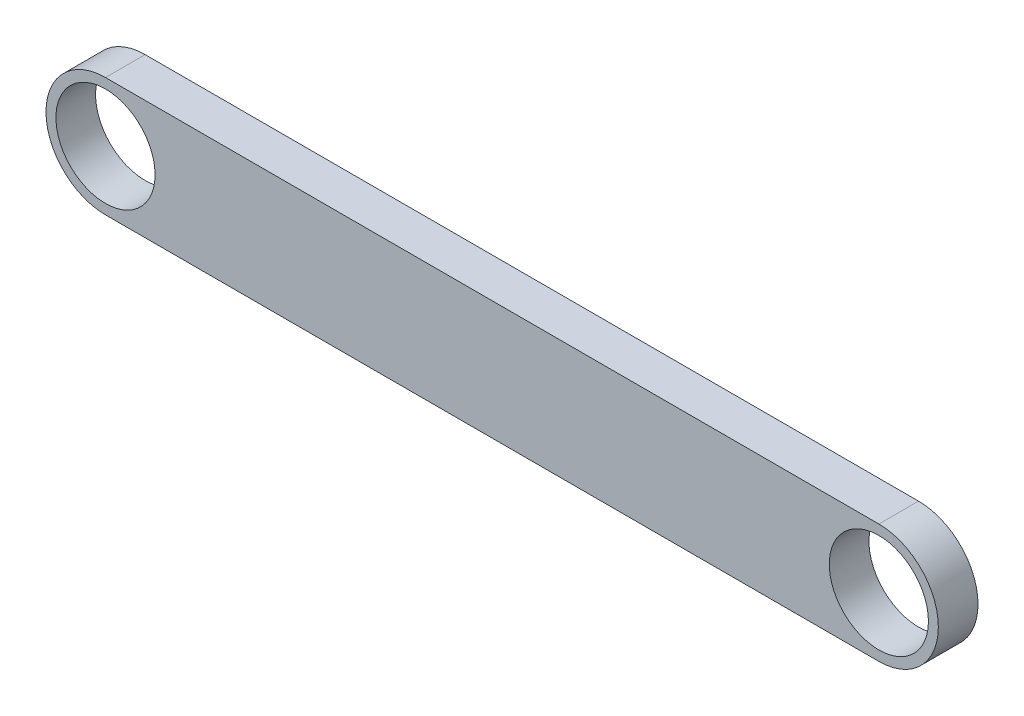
ISO-10303-21;
HEADER;
FILE_DESCRIPTION(('STEP AP214'),'2;1');
FILE_NAME('part.step','',(''),(''),'','','');
FILE_SCHEMA(('AUTOMOTIVE_DESIGN { 1 0 10303 214 1 1 1 1 }'));
ENDSEC;
DATA;
#1=APPLICATION_CONTEXT('core data for automotive mechanical design processes');
#2=APPLICATION_PROTOCOL_DEFINITION('international standard','automotive_design',2000,#1);
#3=PRODUCT_CONTEXT('',#1,'mechanical');
#4=PRODUCT('Part','Part','',(#3));
#5=PRODUCT_RELATED_PRODUCT_CATEGORY('part','',(#4));
#6=PRODUCT_DEFINITION_FORMATION('','',#4);
#7=PRODUCT_DEFINITION_CONTEXT('part definition',#1,'design');
#8=PRODUCT_DEFINITION('design','',#6,#7);
#9=PRODUCT_DEFINITION_SHAPE('','',#8);
#10=(LENGTH_UNIT() NAMED_UNIT(*) SI_UNIT(.MILLI.,.METRE.));
#11=(NAMED_UNIT(*) PLANE_ANGLE_UNIT() SI_UNIT($,.RADIAN.));
#12=(NAMED_UNIT(*) SI_UNIT($,.STERADIAN.) SOLID_ANGLE_UNIT());
#13=UNCERTAINTY_MEASURE_WITH_UNIT(LENGTH_MEASURE(1.E-05),#10,'distance_accuracy_value','');
#14=(GEOMETRIC_REPRESENTATION_CONTEXT(3) GLOBAL_UNCERTAINTY_ASSIGNED_CONTEXT((#13)) GLOBAL_UNIT_ASSIGNED_CONTEXT((#10,
#11,#12)) REPRESENTATION_CONTEXT('',''));
#15=CARTESIAN_POINT('',(0.,0.,0.));
#16=DIRECTION('',(0.,0.,1.));
#17=DIRECTION('',(1.,0.,0.));
#18=AXIS2_PLACEMENT_3D('',#15,#16,#17);
#19=CARTESIAN_POINT('',(0.,0.,10.));
#20=DIRECTION('',(0.,0.,1.));
#21=DIRECTION('',(1.,0.,0.));
#22=AXIS2_PLACEMENT_3D('',#19,#20,#21);
#23=PLANE('',#22);
#24=CARTESIAN_POINT('',(0.,0.,10.));
#25=DIRECTION('',(0.,0.,1.));
#26=DIRECTION('',(1.,0.,0.));
#27=AXIS2_PLACEMENT_3D('',#24,#25,#26);
#28=CIRCLE('',#27,12.5);
#29=CARTESIAN_POINT('',(12.5,0.,10.));
#30=VERTEX_POINT('',#29);
#31=EDGE_CURVE('E100',#30,#30,#28,.T.);
#32=ORIENTED_EDGE('',*,*,#31,.F.);
#33=EDGE_LOOP('',(#32));
#34=FACE_BOUND('',#33,.T.);
#35=CARTESIAN_POINT('',(0.,0.,10.));
#36=DIRECTION('',(0.,0.,1.));
#37=DIRECTION('',(1.,0.,0.));
#38=AXIS2_PLACEMENT_3D('',#35,#36,#37);
#39=CIRCLE('',#38,15.);
#40=CARTESIAN_POINT('',(0.,15.,10.));
#41=VERTEX_POINT('',#40);
#42=CARTESIAN_POINT('',(0.,-15.,10.));
#43=VERTEX_POINT('',#42);
#44=EDGE_CURVE('E85',#41,#43,#39,.T.);
#45=ORIENTED_EDGE('',*,*,#44,.T.);
#46=DIRECTION('',(1.,0.,0.));
#47=VECTOR('',#46,1.);
#48=CARTESIAN_POINT('',(0.,-15.,10.));
#49=LINE('',#48,#47);
#50=CARTESIAN_POINT('',(195.,-15.,10.));
#51=VERTEX_POINT('',#50);
#52=EDGE_CURVE('E80',#43,#51,#49,.T.);
#53=ORIENTED_EDGE('',*,*,#52,.T.);
#54=CARTESIAN_POINT('',(195.,0.,10.));
#55=DIRECTION('',(0.,0.,1.));
#56=DIRECTION('',(1.,0.,0.));
#57=AXIS2_PLACEMENT_3D('',#54,#55,#56);
#58=CIRCLE('',#57,15.);
#59=CARTESIAN_POINT('',(195.,15.,10.));
#60=VERTEX_POINT('',#59);
#61=EDGE_CURVE('E83',#51,#60,#58,.T.);
#62=ORIENTED_EDGE('',*,*,#61,.T.);
#63=DIRECTION('',(-1.,0.,0.));
#64=VECTOR('',#63,1.);
#65=CARTESIAN_POINT('',(0.,15.,10.));
#66=LINE('',#65,#64);
#67=EDGE_CURVE('E50',#60,#41,#66,.T.);
#68=ORIENTED_EDGE('',*,*,#67,.T.);
#69=EDGE_LOOP('',(#45,#53,#62,#68));
#70=FACE_BOUND('',#69,.T.);
#71=CARTESIAN_POINT('',(195.,0.,10.));
#72=DIRECTION('',(0.,0.,1.));
#73=DIRECTION('',(1.,0.,0.));
#74=AXIS2_PLACEMENT_3D('',#71,#72,#73);
#75=CIRCLE('',#74,12.5);
#76=CARTESIAN_POINT('',(207.5,0.,10.));
#77=VERTEX_POINT('',#76);
#78=EDGE_CURVE('E115',#77,#77,#75,.T.);
#79=ORIENTED_EDGE('',*,*,#78,.F.);
#80=EDGE_LOOP('',(#79));
#81=FACE_BOUND('',#80,.T.);
#82=ADVANCED_FACE('F33',(#34,#70,#81),#23,.T.);
#83=CARTESIAN_POINT('',(0.,0.,0.));
#84=DIRECTION('',(0.,0.,1.));
#85=DIRECTION('',(1.,0.,0.));
#86=AXIS2_PLACEMENT_3D('',#83,#84,#85);
#87=PLANE('',#86);
#88=CARTESIAN_POINT('',(0.,0.,0.));
#89=DIRECTION('',(0.,0.,1.));
#90=DIRECTION('',(1.,0.,0.));
#91=AXIS2_PLACEMENT_3D('',#88,#89,#90);
#92=CIRCLE('',#91,15.);
#93=CARTESIAN_POINT('',(0.,15.,0.));
#94=VERTEX_POINT('',#93);
#95=CARTESIAN_POINT('',(0.,-15.,0.));
#96=VERTEX_POINT('',#95);
#97=EDGE_CURVE('E97',#94,#96,#92,.T.);
#98=ORIENTED_EDGE('',*,*,#97,.F.);
#99=DIRECTION('',(-1.,0.,0.));
#100=VECTOR('',#99,1.);
#101=CARTESIAN_POINT('',(0.,15.,0.));
#102=LINE('',#101,#100);
#103=CARTESIAN_POINT('',(195.,15.,0.));
#104=VERTEX_POINT('',#103);
#105=EDGE_CURVE('E73',#104,#94,#102,.T.);
#106=ORIENTED_EDGE('',*,*,#105,.F.);
#107=CARTESIAN_POINT('',(195.,0.,0.));
#108=DIRECTION('',(0.,0.,1.));
#109=DIRECTION('',(1.,0.,0.));
#110=AXIS2_PLACEMENT_3D('',#107,#108,#109);
#111=CIRCLE('',#110,15.);
#112=CARTESIAN_POINT('',(195.,-15.,0.));
#113=VERTEX_POINT('',#112);
#114=EDGE_CURVE('E67',#113,#104,#111,.T.);
#115=ORIENTED_EDGE('',*,*,#114,.F.);
#116=DIRECTION('',(1.,0.,0.));
#117=VECTOR('',#116,1.);
#118=CARTESIAN_POINT('',(0.,-15.,0.));
#119=LINE('',#118,#117);
#120=EDGE_CURVE('E89',#96,#113,#119,.T.);
#121=ORIENTED_EDGE('',*,*,#120,.F.);
#122=EDGE_LOOP('',(#98,#106,#115,#121));
#123=FACE_BOUND('',#122,.T.);
#124=CARTESIAN_POINT('',(0.,0.,0.));
#125=DIRECTION('',(0.,0.,1.));
#126=DIRECTION('',(1.,0.,0.));
#127=AXIS2_PLACEMENT_3D('',#124,#125,#126);
#128=CIRCLE('',#127,12.5);
#129=CARTESIAN_POINT('',(12.5,0.,0.));
#130=VERTEX_POINT('',#129);
#131=EDGE_CURVE('E112',#130,#130,#128,.T.);
#132=ORIENTED_EDGE('',*,*,#131,.T.);
#133=EDGE_LOOP('',(#132));
#134=FACE_BOUND('',#133,.T.);
#135=CARTESIAN_POINT('',(195.,0.,0.));
#136=DIRECTION('',(0.,0.,1.));
#137=DIRECTION('',(1.,0.,0.));
#138=AXIS2_PLACEMENT_3D('',#135,#136,#137);
#139=CIRCLE('',#138,12.5);
#140=CARTESIAN_POINT('',(207.5,0.,0.));
#141=VERTEX_POINT('',#140);
#142=EDGE_CURVE('E118',#141,#141,#139,.T.);
#143=ORIENTED_EDGE('',*,*,#142,.T.);
#144=EDGE_LOOP('',(#143));
#145=FACE_BOUND('',#144,.T.);
#146=ADVANCED_FACE('F108',(#123,#134,#145),#87,.F.);
#147=CARTESIAN_POINT('',(0.,0.,10.));
#148=DIRECTION('',(0.,0.,-1.));
#149=DIRECTION('',(-1.,0.,0.));
#150=AXIS2_PLACEMENT_3D('',#147,#148,#149);
#151=CYLINDRICAL_SURFACE('',#150,15.);
#152=ORIENTED_EDGE('',*,*,#97,.T.);
#153=DIRECTION('',(0.,0.,-1.));
#154=VECTOR('',#153,1.);
#155=CARTESIAN_POINT('',(0.,-15.,10.));
#156=LINE('',#155,#154);
#157=EDGE_CURVE('E11',#43,#96,#156,.T.);
#158=ORIENTED_EDGE('',*,*,#157,.F.);
#159=ORIENTED_EDGE('',*,*,#44,.F.);
#160=DIRECTION('',(0.,0.,-1.));
#161=VECTOR('',#160,1.);
#162=CARTESIAN_POINT('',(0.,15.,10.));
#163=LINE('',#162,#161);
#164=EDGE_CURVE('E93',#41,#94,#163,.T.);
#165=ORIENTED_EDGE('',*,*,#164,.T.);
#166=EDGE_LOOP('',(#152,#158,#159,#165));
#167=FACE_BOUND('',#166,.T.);
#168=ADVANCED_FACE('F35',(#167),#151,.T.);
#169=CARTESIAN_POINT('',(0.,-15.,10.));
#170=DIRECTION('',(0.,1.,0.));
#171=DIRECTION('',(0.,0.,1.));
#172=AXIS2_PLACEMENT_3D('',#169,#170,#171);
#173=PLANE('',#172);
#174=ORIENTED_EDGE('',*,*,#120,.T.);
#175=DIRECTION('',(0.,0.,-1.));
#176=VECTOR('',#175,1.);
#177=CARTESIAN_POINT('',(195.,-15.,10.));
#178=LINE('',#177,#176);
#179=EDGE_CURVE('E42',#51,#113,#178,.T.);
#180=ORIENTED_EDGE('',*,*,#179,.F.);
#181=ORIENTED_EDGE('',*,*,#52,.F.);
#182=ORIENTED_EDGE('',*,*,#157,.T.);
#183=EDGE_LOOP('',(#174,#180,#181,#182));
#184=FACE_BOUND('',#183,.T.);
#185=ADVANCED_FACE('F88',(#184),#173,.F.);
#186=CARTESIAN_POINT('',(195.,0.,10.));
#187=DIRECTION('',(0.,0.,-1.));
#188=DIRECTION('',(-1.,0.,0.));
#189=AXIS2_PLACEMENT_3D('',#186,#187,#188);
#190=CYLINDRICAL_SURFACE('',#189,15.);
#191=ORIENTED_EDGE('',*,*,#114,.T.);
#192=DIRECTION('',(0.,0.,-1.));
#193=VECTOR('',#192,1.);
#194=CARTESIAN_POINT('',(195.,15.,10.));
#195=LINE('',#194,#193);
#196=EDGE_CURVE('E90',#60,#104,#195,.T.);
#197=ORIENTED_EDGE('',*,*,#196,.F.);
#198=ORIENTED_EDGE('',*,*,#61,.F.);
#199=ORIENTED_EDGE('',*,*,#179,.T.);
#200=EDGE_LOOP('',(#191,#197,#198,#199));
#201=FACE_BOUND('',#200,.T.);
#202=ADVANCED_FACE('F91',(#201),#190,.T.);
#203=CARTESIAN_POINT('',(0.,15.,10.));
#204=DIRECTION('',(0.,-1.,0.));
#205=DIRECTION('',(0.,0.,-1.));
#206=AXIS2_PLACEMENT_3D('',#203,#204,#205);
#207=PLANE('',#206);
#208=ORIENTED_EDGE('',*,*,#105,.T.);
#209=ORIENTED_EDGE('',*,*,#164,.F.);
#210=ORIENTED_EDGE('',*,*,#67,.F.);
#211=ORIENTED_EDGE('',*,*,#196,.T.);
#212=EDGE_LOOP('',(#208,#209,#210,#211));
#213=FACE_BOUND('',#212,.T.);
#214=ADVANCED_FACE('F105',(#213),#207,.F.);
#215=CARTESIAN_POINT('',(0.,0.,10.));
#216=DIRECTION('',(0.,0.,-1.));
#217=DIRECTION('',(-1.,0.,0.));
#218=AXIS2_PLACEMENT_3D('',#215,#216,#217);
#219=CYLINDRICAL_SURFACE('',#218,12.5);
#220=ORIENTED_EDGE('',*,*,#31,.T.);
#221=EDGE_LOOP('',(#220));
#222=FACE_BOUND('',#221,.T.);
#223=ORIENTED_EDGE('',*,*,#131,.F.);
#224=EDGE_LOOP('',(#223));
#225=FACE_BOUND('',#224,.T.);
#226=ADVANCED_FACE('F135',(#222,#225),#219,.F.);
#227=CARTESIAN_POINT('',(195.,0.,10.));
#228=DIRECTION('',(0.,0.,-1.));
#229=DIRECTION('',(-1.,0.,0.));
#230=AXIS2_PLACEMENT_3D('',#227,#228,#229);
#231=CYLINDRICAL_SURFACE('',#230,12.5);
#232=ORIENTED_EDGE('',*,*,#78,.T.);
#233=EDGE_LOOP('',(#232));
#234=FACE_BOUND('',#233,.T.);
#235=ORIENTED_EDGE('',*,*,#142,.F.);
#236=EDGE_LOOP('',(#235));
#237=FACE_BOUND('',#236,.T.);
#238=ADVANCED_FACE('F124',(#234,#237),#231,.F.);
#239=CLOSED_SHELL('',(#82,#146,#168,#185,#202,#214,#226,#238));
#240=MANIFOLD_SOLID_BREP('B2',#239);
#241=ADVANCED_BREP_SHAPE_REPRESENTATION('',(#18,#240),#14);
#242=SHAPE_DEFINITION_REPRESENTATION(#9,#241);
ENDSEC;
END-ISO-10303-21;
